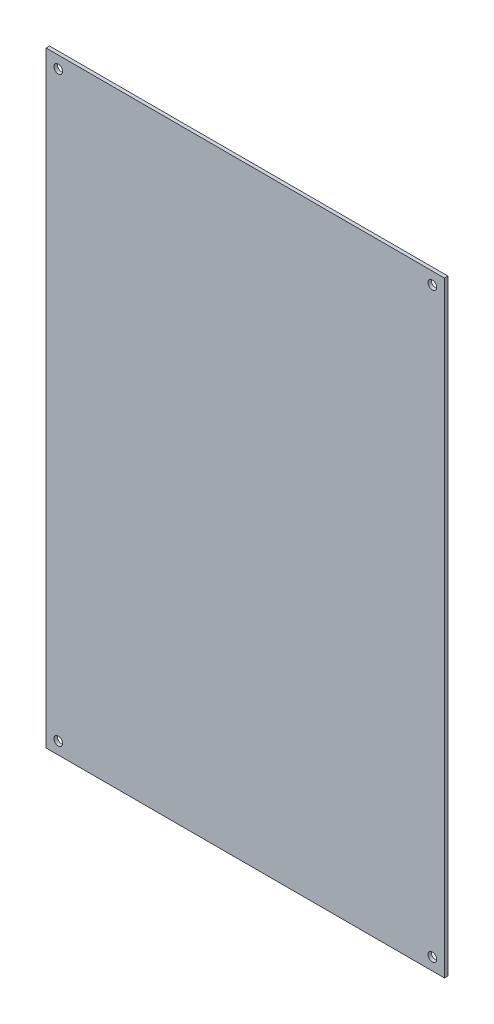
ISO-10303-21;
HEADER;
FILE_DESCRIPTION(('STEP AP214'),'2;1');
FILE_NAME('part.step','',(''),(''),'','','');
FILE_SCHEMA(('AUTOMOTIVE_DESIGN { 1 0 10303 214 1 1 1 1 }'));
ENDSEC;
DATA;
#1=APPLICATION_CONTEXT('core data for automotive mechanical design processes');
#2=APPLICATION_PROTOCOL_DEFINITION('international standard','automotive_design',2000,#1);
#3=PRODUCT_CONTEXT('',#1,'mechanical');
#4=PRODUCT('Part','Part','',(#3));
#5=PRODUCT_RELATED_PRODUCT_CATEGORY('part','',(#4));
#6=PRODUCT_DEFINITION_FORMATION('','',#4);
#7=PRODUCT_DEFINITION_CONTEXT('part definition',#1,'design');
#8=PRODUCT_DEFINITION('design','',#6,#7);
#9=PRODUCT_DEFINITION_SHAPE('','',#8);
#10=(LENGTH_UNIT() NAMED_UNIT(*) SI_UNIT(.MILLI.,.METRE.));
#11=(NAMED_UNIT(*) PLANE_ANGLE_UNIT() SI_UNIT($,.RADIAN.));
#12=(NAMED_UNIT(*) SI_UNIT($,.STERADIAN.) SOLID_ANGLE_UNIT());
#13=UNCERTAINTY_MEASURE_WITH_UNIT(LENGTH_MEASURE(1.E-05),#10,'distance_accuracy_value','');
#14=(GEOMETRIC_REPRESENTATION_CONTEXT(3) GLOBAL_UNCERTAINTY_ASSIGNED_CONTEXT((#13)) GLOBAL_UNIT_ASSIGNED_CONTEXT((#10,
#11,#12)) REPRESENTATION_CONTEXT('',''));
#15=CARTESIAN_POINT('',(0.,0.,0.));
#16=DIRECTION('',(0.,0.,1.));
#17=DIRECTION('',(1.,0.,0.));
#18=AXIS2_PLACEMENT_3D('',#15,#16,#17);
#19=CARTESIAN_POINT('',(-7.,-343.,2.));
#20=DIRECTION('',(0.,0.,1.));
#21=DIRECTION('',(1.,0.,0.));
#22=AXIS2_PLACEMENT_3D('',#19,#20,#21);
#23=PLANE('',#22);
#24=CARTESIAN_POINT('',(216.,-336.,2.));
#25=DIRECTION('',(0.,0.,1.));
#26=DIRECTION('',(1.,0.,0.));
#27=AXIS2_PLACEMENT_3D('',#24,#25,#26);
#28=CIRCLE('',#27,2.5);
#29=CARTESIAN_POINT('',(218.5,-336.,2.));
#30=VERTEX_POINT('',#29);
#31=EDGE_CURVE('E123',#30,#30,#28,.T.);
#32=ORIENTED_EDGE('',*,*,#31,.F.);
#33=EDGE_LOOP('',(#32));
#34=FACE_BOUND('',#33,.T.);
#35=CARTESIAN_POINT('',(0.,0.,2.));
#36=DIRECTION('',(0.,0.,1.));
#37=DIRECTION('',(1.,0.,0.));
#38=AXIS2_PLACEMENT_3D('',#35,#36,#37);
#39=CIRCLE('',#38,2.5);
#40=CARTESIAN_POINT('',(2.5,0.,2.));
#41=VERTEX_POINT('',#40);
#42=EDGE_CURVE('E85',#41,#41,#39,.T.);
#43=ORIENTED_EDGE('',*,*,#42,.F.);
#44=EDGE_LOOP('',(#43));
#45=FACE_BOUND('',#44,.T.);
#46=DIRECTION('',(0.,-1.,0.));
#47=VECTOR('',#46,1.);
#48=CARTESIAN_POINT('',(-7.00000000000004,6.99999999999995,2.));
#49=LINE('',#48,#47);
#50=CARTESIAN_POINT('',(-7.00000000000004,6.99999999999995,2.));
#51=VERTEX_POINT('',#50);
#52=CARTESIAN_POINT('',(-7.,-343.,2.));
#53=VERTEX_POINT('',#52);
#54=EDGE_CURVE('E95',#51,#53,#49,.T.);
#55=ORIENTED_EDGE('',*,*,#54,.T.);
#56=DIRECTION('',(1.,0.,0.));
#57=VECTOR('',#56,1.);
#58=CARTESIAN_POINT('',(-7.,-343.,2.));
#59=LINE('',#58,#57);
#60=CARTESIAN_POINT('',(223.,-343.,2.));
#61=VERTEX_POINT('',#60);
#62=EDGE_CURVE('E80',#53,#61,#59,.T.);
#63=ORIENTED_EDGE('',*,*,#62,.T.);
#64=DIRECTION('',(0.,1.,0.));
#65=VECTOR('',#64,1.);
#66=CARTESIAN_POINT('',(223.,6.99999999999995,2.));
#67=LINE('',#66,#65);
#68=CARTESIAN_POINT('',(223.,6.99999999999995,2.));
#69=VERTEX_POINT('',#68);
#70=EDGE_CURVE('E46',#61,#69,#67,.T.);
#71=ORIENTED_EDGE('',*,*,#70,.T.);
#72=DIRECTION('',(-1.,0.,0.));
#73=VECTOR('',#72,1.);
#74=CARTESIAN_POINT('',(-7.00000000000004,6.99999999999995,2.));
#75=LINE('',#74,#73);
#76=EDGE_CURVE('E41',#69,#51,#75,.T.);
#77=ORIENTED_EDGE('',*,*,#76,.T.);
#78=EDGE_LOOP('',(#55,#63,#71,#77));
#79=FACE_BOUND('',#78,.T.);
#80=CARTESIAN_POINT('',(216.,0.,2.));
#81=DIRECTION('',(0.,0.,1.));
#82=DIRECTION('',(1.,0.,0.));
#83=AXIS2_PLACEMENT_3D('',#80,#81,#82);
#84=CIRCLE('',#83,2.5);
#85=CARTESIAN_POINT('',(218.5,0.,2.));
#86=VERTEX_POINT('',#85);
#87=EDGE_CURVE('E114',#86,#86,#84,.T.);
#88=ORIENTED_EDGE('',*,*,#87,.F.);
#89=EDGE_LOOP('',(#88));
#90=FACE_BOUND('',#89,.T.);
#91=CARTESIAN_POINT('',(0.,-336.,2.));
#92=DIRECTION('',(0.,0.,1.));
#93=DIRECTION('',(1.,0.,0.));
#94=AXIS2_PLACEMENT_3D('',#91,#92,#93);
#95=CIRCLE('',#94,2.5);
#96=CARTESIAN_POINT('',(2.5,-336.,2.));
#97=VERTEX_POINT('',#96);
#98=EDGE_CURVE('E117',#97,#97,#95,.T.);
#99=ORIENTED_EDGE('',*,*,#98,.F.);
#100=EDGE_LOOP('',(#99));
#101=FACE_BOUND('',#100,.T.);
#102=ADVANCED_FACE('F26',(#34,#45,#79,#90,#101),#23,.T.);
#103=CARTESIAN_POINT('',(-7.,-343.,0.));
#104=DIRECTION('',(0.,0.,1.));
#105=DIRECTION('',(1.,0.,0.));
#106=AXIS2_PLACEMENT_3D('',#103,#104,#105);
#107=PLANE('',#106);
#108=CARTESIAN_POINT('',(216.,-336.,0.));
#109=DIRECTION('',(0.,0.,1.));
#110=DIRECTION('',(1.,0.,0.));
#111=AXIS2_PLACEMENT_3D('',#108,#109,#110);
#112=CIRCLE('',#111,2.5);
#113=CARTESIAN_POINT('',(218.5,-336.,0.));
#114=VERTEX_POINT('',#113);
#115=EDGE_CURVE('E119',#114,#114,#112,.T.);
#116=ORIENTED_EDGE('',*,*,#115,.T.);
#117=EDGE_LOOP('',(#116));
#118=FACE_BOUND('',#117,.T.);
#119=CARTESIAN_POINT('',(0.,0.,0.));
#120=DIRECTION('',(0.,0.,1.));
#121=DIRECTION('',(1.,0.,0.));
#122=AXIS2_PLACEMENT_3D('',#119,#120,#121);
#123=CIRCLE('',#122,2.5);
#124=CARTESIAN_POINT('',(2.5,0.,0.));
#125=VERTEX_POINT('',#124);
#126=EDGE_CURVE('E88',#125,#125,#123,.T.);
#127=ORIENTED_EDGE('',*,*,#126,.T.);
#128=EDGE_LOOP('',(#127));
#129=FACE_BOUND('',#128,.T.);
#130=DIRECTION('',(0.,-1.,0.));
#131=VECTOR('',#130,1.);
#132=CARTESIAN_POINT('',(-7.00000000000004,6.99999999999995,0.));
#133=LINE('',#132,#131);
#134=CARTESIAN_POINT('',(-7.00000000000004,6.99999999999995,0.));
#135=VERTEX_POINT('',#134);
#136=CARTESIAN_POINT('',(-7.,-343.,0.));
#137=VERTEX_POINT('',#136);
#138=EDGE_CURVE('E72',#135,#137,#133,.T.);
#139=ORIENTED_EDGE('',*,*,#138,.F.);
#140=DIRECTION('',(-1.,0.,0.));
#141=VECTOR('',#140,1.);
#142=CARTESIAN_POINT('',(-7.00000000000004,6.99999999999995,0.));
#143=LINE('',#142,#141);
#144=CARTESIAN_POINT('',(223.,6.99999999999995,0.));
#145=VERTEX_POINT('',#144);
#146=EDGE_CURVE('E93',#145,#135,#143,.T.);
#147=ORIENTED_EDGE('',*,*,#146,.F.);
#148=DIRECTION('',(0.,1.,0.));
#149=VECTOR('',#148,1.);
#150=CARTESIAN_POINT('',(223.,6.99999999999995,0.));
#151=LINE('',#150,#149);
#152=CARTESIAN_POINT('',(223.,-343.,0.));
#153=VERTEX_POINT('',#152);
#154=EDGE_CURVE('E73',#153,#145,#151,.T.);
#155=ORIENTED_EDGE('',*,*,#154,.F.);
#156=DIRECTION('',(1.,0.,0.));
#157=VECTOR('',#156,1.);
#158=CARTESIAN_POINT('',(-7.,-343.,0.));
#159=LINE('',#158,#157);
#160=EDGE_CURVE('E67',#137,#153,#159,.T.);
#161=ORIENTED_EDGE('',*,*,#160,.F.);
#162=EDGE_LOOP('',(#139,#147,#155,#161));
#163=FACE_BOUND('',#162,.T.);
#164=CARTESIAN_POINT('',(216.,0.,0.));
#165=DIRECTION('',(0.,0.,1.));
#166=DIRECTION('',(1.,0.,0.));
#167=AXIS2_PLACEMENT_3D('',#164,#165,#166);
#168=CIRCLE('',#167,2.5);
#169=CARTESIAN_POINT('',(218.5,0.,0.));
#170=VERTEX_POINT('',#169);
#171=EDGE_CURVE('E130',#170,#170,#168,.T.);
#172=ORIENTED_EDGE('',*,*,#171,.T.);
#173=EDGE_LOOP('',(#172));
#174=FACE_BOUND('',#173,.T.);
#175=CARTESIAN_POINT('',(0.,-336.,0.));
#176=DIRECTION('',(0.,0.,1.));
#177=DIRECTION('',(1.,0.,0.));
#178=AXIS2_PLACEMENT_3D('',#175,#176,#177);
#179=CIRCLE('',#178,2.5);
#180=CARTESIAN_POINT('',(2.5,-336.,0.));
#181=VERTEX_POINT('',#180);
#182=EDGE_CURVE('E120',#181,#181,#179,.T.);
#183=ORIENTED_EDGE('',*,*,#182,.T.);
#184=EDGE_LOOP('',(#183));
#185=FACE_BOUND('',#184,.T.);
#186=ADVANCED_FACE('F68',(#118,#129,#163,#174,#185),#107,.F.);
#187=CARTESIAN_POINT('',(-7.00000000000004,6.99999999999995,2.));
#188=DIRECTION('',(1.,0.,0.));
#189=DIRECTION('',(0.,1.,0.));
#190=AXIS2_PLACEMENT_3D('',#187,#188,#189);
#191=PLANE('',#190);
#192=ORIENTED_EDGE('',*,*,#138,.T.);
#193=DIRECTION('',(0.,0.,-1.));
#194=VECTOR('',#193,1.);
#195=CARTESIAN_POINT('',(-7.,-343.,2.));
#196=LINE('',#195,#194);
#197=EDGE_CURVE('E11',#53,#137,#196,.T.);
#198=ORIENTED_EDGE('',*,*,#197,.F.);
#199=ORIENTED_EDGE('',*,*,#54,.F.);
#200=DIRECTION('',(0.,0.,-1.));
#201=VECTOR('',#200,1.);
#202=CARTESIAN_POINT('',(-7.00000000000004,6.99999999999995,2.));
#203=LINE('',#202,#201);
#204=EDGE_CURVE('E84',#51,#135,#203,.T.);
#205=ORIENTED_EDGE('',*,*,#204,.T.);
#206=EDGE_LOOP('',(#192,#198,#199,#205));
#207=FACE_BOUND('',#206,.T.);
#208=ADVANCED_FACE('F28',(#207),#191,.F.);
#209=CARTESIAN_POINT('',(-7.,-343.,2.));
#210=DIRECTION('',(0.,1.,0.));
#211=DIRECTION('',(0.,0.,1.));
#212=AXIS2_PLACEMENT_3D('',#209,#210,#211);
#213=PLANE('',#212);
#214=ORIENTED_EDGE('',*,*,#160,.T.);
#215=DIRECTION('',(0.,0.,-1.));
#216=VECTOR('',#215,1.);
#217=CARTESIAN_POINT('',(223.,-343.,2.));
#218=LINE('',#217,#216);
#219=EDGE_CURVE('E34',#61,#153,#218,.T.);
#220=ORIENTED_EDGE('',*,*,#219,.F.);
#221=ORIENTED_EDGE('',*,*,#62,.F.);
#222=ORIENTED_EDGE('',*,*,#197,.T.);
#223=EDGE_LOOP('',(#214,#220,#221,#222));
#224=FACE_BOUND('',#223,.T.);
#225=ADVANCED_FACE('F79',(#224),#213,.F.);
#226=CARTESIAN_POINT('',(223.,6.99999999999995,2.));
#227=DIRECTION('',(-1.,0.,0.));
#228=DIRECTION('',(0.,-1.,0.));
#229=AXIS2_PLACEMENT_3D('',#226,#227,#228);
#230=PLANE('',#229);
#231=ORIENTED_EDGE('',*,*,#154,.T.);
#232=DIRECTION('',(0.,0.,-1.));
#233=VECTOR('',#232,1.);
#234=CARTESIAN_POINT('',(223.,6.99999999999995,2.));
#235=LINE('',#234,#233);
#236=EDGE_CURVE('E101',#69,#145,#235,.T.);
#237=ORIENTED_EDGE('',*,*,#236,.F.);
#238=ORIENTED_EDGE('',*,*,#70,.F.);
#239=ORIENTED_EDGE('',*,*,#219,.T.);
#240=EDGE_LOOP('',(#231,#237,#238,#239));
#241=FACE_BOUND('',#240,.T.);
#242=ADVANCED_FACE('F104',(#241),#230,.F.);
#243=CARTESIAN_POINT('',(-7.00000000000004,6.99999999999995,2.));
#244=DIRECTION('',(0.,-1.,0.));
#245=DIRECTION('',(1.,0.,0.));
#246=AXIS2_PLACEMENT_3D('',#243,#244,#245);
#247=PLANE('',#246);
#248=ORIENTED_EDGE('',*,*,#146,.T.);
#249=ORIENTED_EDGE('',*,*,#204,.F.);
#250=ORIENTED_EDGE('',*,*,#76,.F.);
#251=ORIENTED_EDGE('',*,*,#236,.T.);
#252=EDGE_LOOP('',(#248,#249,#250,#251));
#253=FACE_BOUND('',#252,.T.);
#254=ADVANCED_FACE('F106',(#253),#247,.F.);
#255=CARTESIAN_POINT('',(0.,0.,2.));
#256=DIRECTION('',(0.,0.,-1.));
#257=DIRECTION('',(-1.,0.,0.));
#258=AXIS2_PLACEMENT_3D('',#255,#256,#257);
#259=CYLINDRICAL_SURFACE('',#258,2.5);
#260=ORIENTED_EDGE('',*,*,#42,.T.);
#261=EDGE_LOOP('',(#260));
#262=FACE_BOUND('',#261,.T.);
#263=ORIENTED_EDGE('',*,*,#126,.F.);
#264=EDGE_LOOP('',(#263));
#265=FACE_BOUND('',#264,.T.);
#266=ADVANCED_FACE('F137',(#262,#265),#259,.F.);
#267=CARTESIAN_POINT('',(216.,0.,2.));
#268=DIRECTION('',(0.,0.,-1.));
#269=DIRECTION('',(-1.,0.,0.));
#270=AXIS2_PLACEMENT_3D('',#267,#268,#269);
#271=CYLINDRICAL_SURFACE('',#270,2.5);
#272=ORIENTED_EDGE('',*,*,#87,.T.);
#273=EDGE_LOOP('',(#272));
#274=FACE_BOUND('',#273,.T.);
#275=ORIENTED_EDGE('',*,*,#171,.F.);
#276=EDGE_LOOP('',(#275));
#277=FACE_BOUND('',#276,.T.);
#278=ADVANCED_FACE('F139',(#274,#277),#271,.F.);
#279=CARTESIAN_POINT('',(216.,-336.,2.));
#280=DIRECTION('',(0.,0.,-1.));
#281=DIRECTION('',(-1.,0.,0.));
#282=AXIS2_PLACEMENT_3D('',#279,#280,#281);
#283=CYLINDRICAL_SURFACE('',#282,2.5);
#284=ORIENTED_EDGE('',*,*,#31,.T.);
#285=EDGE_LOOP('',(#284));
#286=FACE_BOUND('',#285,.T.);
#287=ORIENTED_EDGE('',*,*,#115,.F.);
#288=EDGE_LOOP('',(#287));
#289=FACE_BOUND('',#288,.T.);
#290=ADVANCED_FACE('F146',(#286,#289),#283,.F.);
#291=CARTESIAN_POINT('',(0.,-336.,2.));
#292=DIRECTION('',(0.,0.,-1.));
#293=DIRECTION('',(-1.,0.,0.));
#294=AXIS2_PLACEMENT_3D('',#291,#292,#293);
#295=CYLINDRICAL_SURFACE('',#294,2.5);
#296=ORIENTED_EDGE('',*,*,#98,.T.);
#297=EDGE_LOOP('',(#296));
#298=FACE_BOUND('',#297,.T.);
#299=ORIENTED_EDGE('',*,*,#182,.F.);
#300=EDGE_LOOP('',(#299));
#301=FACE_BOUND('',#300,.T.);
#302=ADVANCED_FACE('F193',(#298,#301),#295,.F.);
#303=CLOSED_SHELL('',(#102,#186,#208,#225,#242,#254,#266,#278,#290,#302));
#304=MANIFOLD_SOLID_BREP('B2',#303);
#305=ADVANCED_BREP_SHAPE_REPRESENTATION('',(#18,#304),#14);
#306=SHAPE_DEFINITION_REPRESENTATION(#9,#305);
ENDSEC;
END-ISO-10303-21;
